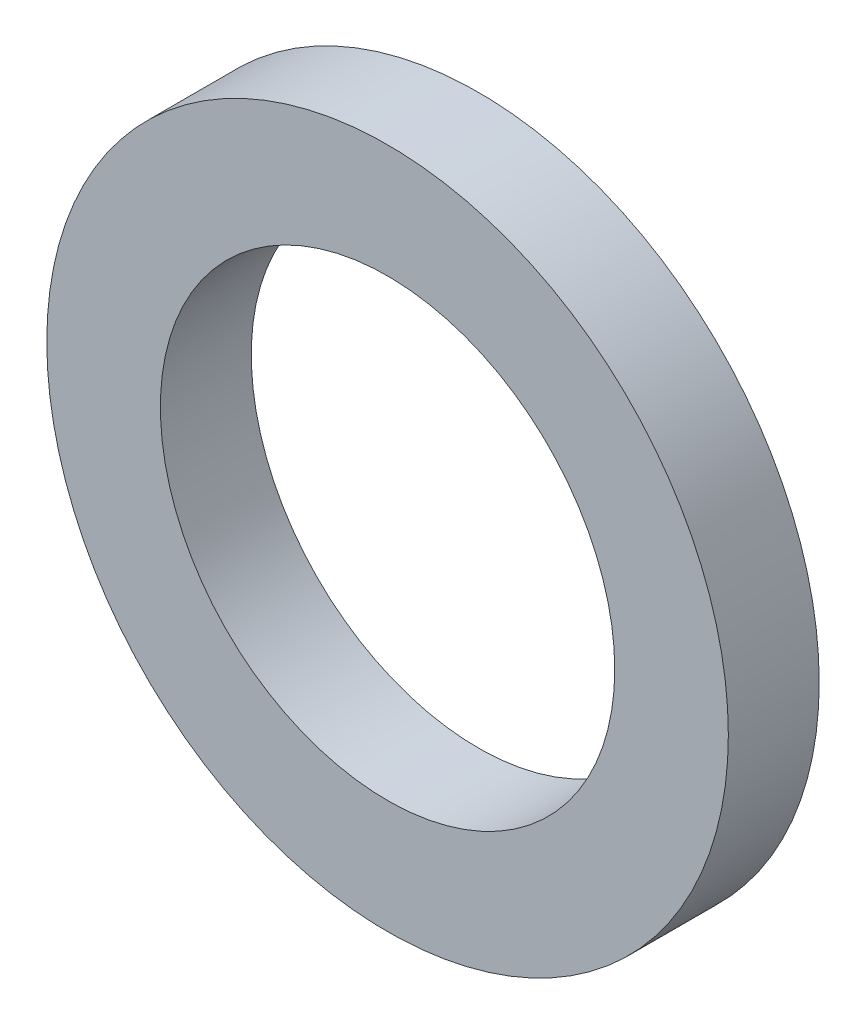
ISO-10303-21;
HEADER;
FILE_DESCRIPTION(('STEP AP214'),'2;1');
FILE_NAME('part.step','',(''),(''),'','','');
FILE_SCHEMA(('AUTOMOTIVE_DESIGN { 1 0 10303 214 1 1 1 1 }'));
ENDSEC;
DATA;
#1=APPLICATION_CONTEXT('core data for automotive mechanical design processes');
#2=APPLICATION_PROTOCOL_DEFINITION('international standard','automotive_design',2000,#1);
#3=PRODUCT_CONTEXT('',#1,'mechanical');
#4=PRODUCT('Part','Part','',(#3));
#5=PRODUCT_RELATED_PRODUCT_CATEGORY('part','',(#4));
#6=PRODUCT_DEFINITION_FORMATION('','',#4);
#7=PRODUCT_DEFINITION_CONTEXT('part definition',#1,'design');
#8=PRODUCT_DEFINITION('design','',#6,#7);
#9=PRODUCT_DEFINITION_SHAPE('','',#8);
#10=(LENGTH_UNIT() NAMED_UNIT(*) SI_UNIT(.MILLI.,.METRE.));
#11=(NAMED_UNIT(*) PLANE_ANGLE_UNIT() SI_UNIT($,.RADIAN.));
#12=(NAMED_UNIT(*) SI_UNIT($,.STERADIAN.) SOLID_ANGLE_UNIT());
#13=UNCERTAINTY_MEASURE_WITH_UNIT(LENGTH_MEASURE(1.E-05),#10,'distance_accuracy_value','');
#14=(GEOMETRIC_REPRESENTATION_CONTEXT(3) GLOBAL_UNCERTAINTY_ASSIGNED_CONTEXT((#13)) GLOBAL_UNIT_ASSIGNED_CONTEXT((#10,
#11,#12)) REPRESENTATION_CONTEXT('',''));
#15=CARTESIAN_POINT('',(0.,0.,0.));
#16=DIRECTION('',(0.,0.,1.));
#17=DIRECTION('',(1.,0.,0.));
#18=AXIS2_PLACEMENT_3D('',#15,#16,#17);
#19=CARTESIAN_POINT('',(0.,5.,0.));
#20=DIRECTION('',(0.,0.,-1.));
#21=DIRECTION('',(-1.,0.,0.));
#22=AXIS2_PLACEMENT_3D('',#19,#20,#21);
#23=PLANE('',#22);
#24=CARTESIAN_POINT('',(0.,0.,0.));
#25=DIRECTION('',(0.,0.,1.));
#26=DIRECTION('',(1.,0.,0.));
#27=AXIS2_PLACEMENT_3D('',#24,#25,#26);
#28=CIRCLE('',#27,5.);
#29=CARTESIAN_POINT('',(5.,0.,0.));
#30=VERTEX_POINT('',#29);
#31=EDGE_CURVE('E41',#30,#30,#28,.T.);
#32=ORIENTED_EDGE('',*,*,#31,.F.);
#33=EDGE_LOOP('',(#32));
#34=FACE_BOUND('',#33,.T.);
#35=CARTESIAN_POINT('',(0.,0.,0.));
#36=DIRECTION('',(0.,0.,1.));
#37=DIRECTION('',(1.,0.,0.));
#38=AXIS2_PLACEMENT_3D('',#35,#36,#37);
#39=CIRCLE('',#38,7.5);
#40=CARTESIAN_POINT('',(7.5,0.,0.));
#41=VERTEX_POINT('',#40);
#42=EDGE_CURVE('E10',#41,#41,#39,.T.);
#43=ORIENTED_EDGE('',*,*,#42,.T.);
#44=EDGE_LOOP('',(#43));
#45=FACE_BOUND('',#44,.T.);
#46=ADVANCED_FACE('F27',(#34,#45),#23,.F.);
#47=CARTESIAN_POINT('',(0.,0.,0.));
#48=DIRECTION('',(0.,0.,1.));
#49=DIRECTION('',(1.,0.,0.));
#50=AXIS2_PLACEMENT_3D('',#47,#48,#49);
#51=CYLINDRICAL_SURFACE('',#50,7.5);
#52=ORIENTED_EDGE('',*,*,#42,.F.);
#53=EDGE_LOOP('',(#52));
#54=FACE_BOUND('',#53,.T.);
#55=CARTESIAN_POINT('',(0.,0.,-2.));
#56=DIRECTION('',(0.,0.,1.));
#57=DIRECTION('',(1.,0.,0.));
#58=AXIS2_PLACEMENT_3D('',#55,#56,#57);
#59=CIRCLE('',#58,7.5);
#60=CARTESIAN_POINT('',(7.5,0.,-2.));
#61=VERTEX_POINT('',#60);
#62=EDGE_CURVE('E33',#61,#61,#59,.T.);
#63=ORIENTED_EDGE('',*,*,#62,.T.);
#64=EDGE_LOOP('',(#63));
#65=FACE_BOUND('',#64,.T.);
#66=ADVANCED_FACE('F50',(#54,#65),#51,.T.);
#67=CARTESIAN_POINT('',(0.,5.,-2.));
#68=DIRECTION('',(0.,0.,1.));
#69=DIRECTION('',(1.,0.,0.));
#70=AXIS2_PLACEMENT_3D('',#67,#68,#69);
#71=PLANE('',#70);
#72=ORIENTED_EDGE('',*,*,#62,.F.);
#73=EDGE_LOOP('',(#72));
#74=FACE_BOUND('',#73,.T.);
#75=CARTESIAN_POINT('',(0.,0.,-2.));
#76=DIRECTION('',(0.,0.,1.));
#77=DIRECTION('',(1.,0.,0.));
#78=AXIS2_PLACEMENT_3D('',#75,#76,#77);
#79=CIRCLE('',#78,5.);
#80=CARTESIAN_POINT('',(5.,0.,-2.));
#81=VERTEX_POINT('',#80);
#82=EDGE_CURVE('E37',#81,#81,#79,.T.);
#83=ORIENTED_EDGE('',*,*,#82,.T.);
#84=EDGE_LOOP('',(#83));
#85=FACE_BOUND('',#84,.T.);
#86=ADVANCED_FACE('F54',(#74,#85),#71,.F.);
#87=CARTESIAN_POINT('',(0.,0.,0.));
#88=DIRECTION('',(0.,0.,1.));
#89=DIRECTION('',(1.,0.,0.));
#90=AXIS2_PLACEMENT_3D('',#87,#88,#89);
#91=CYLINDRICAL_SURFACE('',#90,5.);
#92=ORIENTED_EDGE('',*,*,#82,.F.);
#93=EDGE_LOOP('',(#92));
#94=FACE_BOUND('',#93,.T.);
#95=ORIENTED_EDGE('',*,*,#31,.T.);
#96=EDGE_LOOP('',(#95));
#97=FACE_BOUND('',#96,.T.);
#98=ADVANCED_FACE('F47',(#94,#97),#91,.F.);
#99=CLOSED_SHELL('',(#46,#66,#86,#98));
#100=MANIFOLD_SOLID_BREP('B2',#99);
#101=ADVANCED_BREP_SHAPE_REPRESENTATION('',(#18,#100),#14);
#102=SHAPE_DEFINITION_REPRESENTATION(#9,#101);
ENDSEC;
END-ISO-10303-21;
